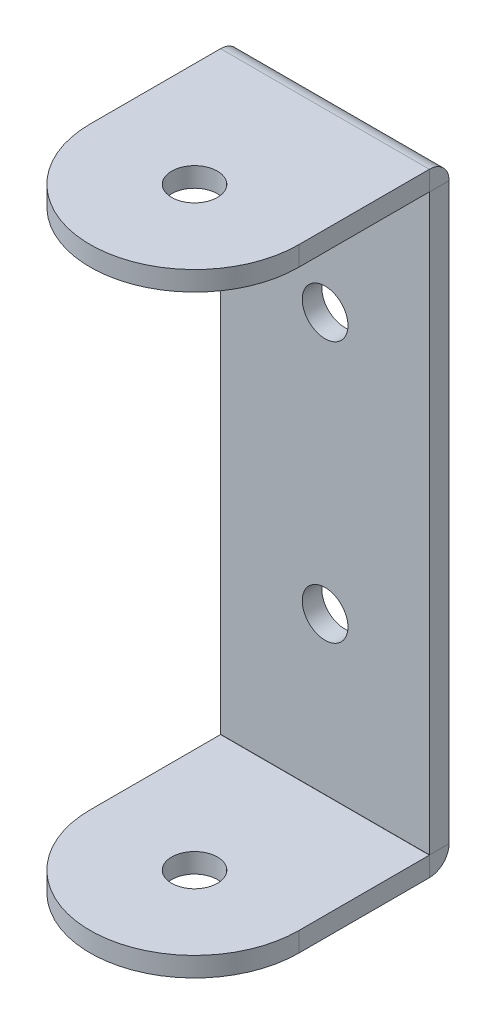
ISO-10303-21;
HEADER;
FILE_DESCRIPTION(('STEP AP214'),'2;1');
FILE_NAME('part.step','',(''),(''),'','','');
FILE_SCHEMA(('AUTOMOTIVE_DESIGN { 1 0 10303 214 1 1 1 1 }'));
ENDSEC;
DATA;
#1=APPLICATION_CONTEXT('core data for automotive mechanical design processes');
#2=APPLICATION_PROTOCOL_DEFINITION('international standard','automotive_design',2000,#1);
#3=PRODUCT_CONTEXT('',#1,'mechanical');
#4=PRODUCT('Part','Part','',(#3));
#5=PRODUCT_RELATED_PRODUCT_CATEGORY('part','',(#4));
#6=PRODUCT_DEFINITION_FORMATION('','',#4);
#7=PRODUCT_DEFINITION_CONTEXT('part definition',#1,'design');
#8=PRODUCT_DEFINITION('design','',#6,#7);
#9=PRODUCT_DEFINITION_SHAPE('','',#8);
#10=(LENGTH_UNIT() NAMED_UNIT(*) SI_UNIT(.MILLI.,.METRE.));
#11=(NAMED_UNIT(*) PLANE_ANGLE_UNIT() SI_UNIT($,.RADIAN.));
#12=(NAMED_UNIT(*) SI_UNIT($,.STERADIAN.) SOLID_ANGLE_UNIT());
#13=UNCERTAINTY_MEASURE_WITH_UNIT(LENGTH_MEASURE(1.E-05),#10,'distance_accuracy_value','');
#14=(GEOMETRIC_REPRESENTATION_CONTEXT(3) GLOBAL_UNCERTAINTY_ASSIGNED_CONTEXT((#13)) GLOBAL_UNIT_ASSIGNED_CONTEXT((#10,
#11,#12)) REPRESENTATION_CONTEXT('',''));
#15=CARTESIAN_POINT('',(0.,0.,0.));
#16=DIRECTION('',(0.,0.,1.));
#17=DIRECTION('',(1.,0.,0.));
#18=AXIS2_PLACEMENT_3D('',#15,#16,#17);
#19=CARTESIAN_POINT('',(0.,64.,1.5));
#20=DIRECTION('',(0.,0.,1.));
#21=DIRECTION('',(1.,0.,0.));
#22=AXIS2_PLACEMENT_3D('',#19,#20,#21);
#23=PLANE('',#22);
#24=CARTESIAN_POINT('',(0.,22.,1.5));
#25=DIRECTION('',(0.,0.,1.));
#26=DIRECTION('',(1.,0.,0.));
#27=AXIS2_PLACEMENT_3D('',#24,#25,#26);
#28=CIRCLE('',#27,1.75);
#29=CARTESIAN_POINT('',(1.75,22.,1.5));
#30=VERTEX_POINT('',#29);
#31=EDGE_CURVE('E231',#30,#30,#28,.T.);
#32=ORIENTED_EDGE('',*,*,#31,.F.);
#33=EDGE_LOOP('',(#32));
#34=FACE_BOUND('',#33,.T.);
#35=CARTESIAN_POINT('',(0.,42.,1.5));
#36=DIRECTION('',(0.,0.,1.));
#37=DIRECTION('',(1.,0.,0.));
#38=AXIS2_PLACEMENT_3D('',#35,#36,#37);
#39=CIRCLE('',#38,1.75);
#40=CARTESIAN_POINT('',(1.75,42.,1.5));
#41=VERTEX_POINT('',#40);
#42=EDGE_CURVE('E237',#41,#41,#39,.T.);
#43=ORIENTED_EDGE('',*,*,#42,.F.);
#44=EDGE_LOOP('',(#43));
#45=FACE_BOUND('',#44,.T.);
#46=DIRECTION('',(0.,-1.,0.));
#47=VECTOR('',#46,1.);
#48=CARTESIAN_POINT('',(-8.00000000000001,0.,1.5));
#49=LINE('',#48,#47);
#50=CARTESIAN_POINT('',(-8.00000000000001,53.9921342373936,1.5));
#51=VERTEX_POINT('',#50);
#52=CARTESIAN_POINT('',(-8.00000000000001,10.0078657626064,1.5));
#53=VERTEX_POINT('',#52);
#54=EDGE_CURVE('E45',#51,#53,#49,.T.);
#55=ORIENTED_EDGE('',*,*,#54,.T.);
#56=DIRECTION('',(1.,0.,0.));
#57=VECTOR('',#56,1.);
#58=CARTESIAN_POINT('',(0.,10.0078657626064,1.5));
#59=LINE('',#58,#57);
#60=CARTESIAN_POINT('',(8.00000000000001,10.0078657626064,1.5));
#61=VERTEX_POINT('',#60);
#62=EDGE_CURVE('E255',#53,#61,#59,.T.);
#63=ORIENTED_EDGE('',*,*,#62,.T.);
#64=DIRECTION('',(0.,1.,0.));
#65=VECTOR('',#64,1.);
#66=CARTESIAN_POINT('',(8.,64.,1.5));
#67=LINE('',#66,#65);
#68=CARTESIAN_POINT('',(8.,53.9921342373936,1.5));
#69=VERTEX_POINT('',#68);
#70=EDGE_CURVE('E246',#61,#69,#67,.T.);
#71=ORIENTED_EDGE('',*,*,#70,.T.);
#72=DIRECTION('',(-1.,0.,0.));
#73=VECTOR('',#72,1.);
#74=CARTESIAN_POINT('',(0.,53.9921342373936,1.5));
#75=LINE('',#74,#73);
#76=EDGE_CURVE('E242',#69,#51,#75,.T.);
#77=ORIENTED_EDGE('',*,*,#76,.T.);
#78=EDGE_LOOP('',(#55,#63,#71,#77));
#79=FACE_BOUND('',#78,.T.);
#80=ADVANCED_FACE('F41',(#34,#45,#79),#23,.T.);
#81=CARTESIAN_POINT('',(0.,64.,0.));
#82=DIRECTION('',(0.,0.,1.));
#83=DIRECTION('',(1.,0.,0.));
#84=AXIS2_PLACEMENT_3D('',#81,#82,#83);
#85=PLANE('',#84);
#86=DIRECTION('',(1.,0.,0.));
#87=VECTOR('',#86,1.);
#88=CARTESIAN_POINT('',(0.,10.0078657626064,0.));
#89=LINE('',#88,#87);
#90=CARTESIAN_POINT('',(-8.00000000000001,10.0078657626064,0.));
#91=VERTEX_POINT('',#90);
#92=CARTESIAN_POINT('',(8.00000000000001,10.0078657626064,0.));
#93=VERTEX_POINT('',#92);
#94=EDGE_CURVE('E50',#91,#93,#89,.T.);
#95=ORIENTED_EDGE('',*,*,#94,.F.);
#96=DIRECTION('',(0.,-1.,0.));
#97=VECTOR('',#96,1.);
#98=CARTESIAN_POINT('',(-8.00000000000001,0.,0.));
#99=LINE('',#98,#97);
#100=CARTESIAN_POINT('',(-8.00000000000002,53.9921342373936,0.));
#101=VERTEX_POINT('',#100);
#102=EDGE_CURVE('E66',#101,#91,#99,.T.);
#103=ORIENTED_EDGE('',*,*,#102,.F.);
#104=DIRECTION('',(-1.,0.,0.));
#105=VECTOR('',#104,1.);
#106=CARTESIAN_POINT('',(0.,53.9921342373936,0.));
#107=LINE('',#106,#105);
#108=CARTESIAN_POINT('',(8.,53.9921342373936,0.));
#109=VERTEX_POINT('',#108);
#110=EDGE_CURVE('E249',#109,#101,#107,.T.);
#111=ORIENTED_EDGE('',*,*,#110,.F.);
#112=DIRECTION('',(0.,1.,0.));
#113=VECTOR('',#112,1.);
#114=CARTESIAN_POINT('',(8.,64.,0.));
#115=LINE('',#114,#113);
#116=EDGE_CURVE('E58',#93,#109,#115,.T.);
#117=ORIENTED_EDGE('',*,*,#116,.F.);
#118=EDGE_LOOP('',(#95,#103,#111,#117));
#119=FACE_BOUND('',#118,.T.);
#120=CARTESIAN_POINT('',(0.,22.,0.));
#121=DIRECTION('',(0.,0.,1.));
#122=DIRECTION('',(1.,0.,0.));
#123=AXIS2_PLACEMENT_3D('',#120,#121,#122);
#124=CIRCLE('',#123,1.75);
#125=CARTESIAN_POINT('',(1.75,22.,0.));
#126=VERTEX_POINT('',#125);
#127=EDGE_CURVE('E226',#126,#126,#124,.T.);
#128=ORIENTED_EDGE('',*,*,#127,.T.);
#129=EDGE_LOOP('',(#128));
#130=FACE_BOUND('',#129,.T.);
#131=CARTESIAN_POINT('',(0.,42.,0.));
#132=DIRECTION('',(0.,0.,1.));
#133=DIRECTION('',(1.,0.,0.));
#134=AXIS2_PLACEMENT_3D('',#131,#132,#133);
#135=CIRCLE('',#134,1.75);
#136=CARTESIAN_POINT('',(1.75,42.,0.));
#137=VERTEX_POINT('',#136);
#138=EDGE_CURVE('E234',#137,#137,#135,.T.);
#139=ORIENTED_EDGE('',*,*,#138,.T.);
#140=EDGE_LOOP('',(#139));
#141=FACE_BOUND('',#140,.T.);
#142=ADVANCED_FACE('F294',(#119,#130,#141),#85,.F.);
#143=CARTESIAN_POINT('',(-8.00000000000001,0.,1.5));
#144=DIRECTION('',(1.,0.,0.));
#145=DIRECTION('',(0.,1.,0.));
#146=AXIS2_PLACEMENT_3D('',#143,#144,#145);
#147=PLANE('',#146);
#148=DIRECTION('',(0.,0.,-1.));
#149=VECTOR('',#148,1.);
#150=CARTESIAN_POINT('',(-8.00000000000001,10.0078657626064,1.50000000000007));
#151=LINE('',#150,#149);
#152=EDGE_CURVE('E258',#53,#91,#151,.T.);
#153=ORIENTED_EDGE('',*,*,#152,.F.);
#154=ORIENTED_EDGE('',*,*,#54,.F.);
#155=DIRECTION('',(0.,0.,1.));
#156=VECTOR('',#155,1.);
#157=CARTESIAN_POINT('',(-8.00000000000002,53.9921342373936,1.50000000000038));
#158=LINE('',#157,#156);
#159=EDGE_CURVE('E252',#101,#51,#158,.T.);
#160=ORIENTED_EDGE('',*,*,#159,.F.);
#161=ORIENTED_EDGE('',*,*,#102,.T.);
#162=EDGE_LOOP('',(#153,#154,#160,#161));
#163=FACE_BOUND('',#162,.T.);
#164=ADVANCED_FACE('F268',(#163),#147,.F.);
#165=CARTESIAN_POINT('',(8.,64.,1.5));
#166=DIRECTION('',(-1.,0.,0.));
#167=DIRECTION('',(0.,-1.,0.));
#168=AXIS2_PLACEMENT_3D('',#165,#166,#167);
#169=PLANE('',#168);
#170=DIRECTION('',(0.,0.,1.));
#171=VECTOR('',#170,1.);
#172=CARTESIAN_POINT('',(8.00000000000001,10.0078657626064,1.49999999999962));
#173=LINE('',#172,#171);
#174=EDGE_CURVE('E12',#93,#61,#173,.T.);
#175=ORIENTED_EDGE('',*,*,#174,.F.);
#176=ORIENTED_EDGE('',*,*,#116,.T.);
#177=DIRECTION('',(0.,0.,-1.));
#178=VECTOR('',#177,1.);
#179=CARTESIAN_POINT('',(8.,53.9921342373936,1.49999999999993));
#180=LINE('',#179,#178);
#181=EDGE_CURVE('E245',#69,#109,#180,.T.);
#182=ORIENTED_EDGE('',*,*,#181,.F.);
#183=ORIENTED_EDGE('',*,*,#70,.F.);
#184=EDGE_LOOP('',(#175,#176,#182,#183));
#185=FACE_BOUND('',#184,.T.);
#186=ADVANCED_FACE('F43',(#185),#169,.F.);
#187=CARTESIAN_POINT('',(0.,42.,1.5));
#188=DIRECTION('',(0.,0.,-1.));
#189=DIRECTION('',(-1.,0.,0.));
#190=AXIS2_PLACEMENT_3D('',#187,#188,#189);
#191=CYLINDRICAL_SURFACE('',#190,1.75);
#192=ORIENTED_EDGE('',*,*,#42,.T.);
#193=EDGE_LOOP('',(#192));
#194=FACE_BOUND('',#193,.T.);
#195=ORIENTED_EDGE('',*,*,#138,.F.);
#196=EDGE_LOOP('',(#195));
#197=FACE_BOUND('',#196,.T.);
#198=ADVANCED_FACE('F347',(#194,#197),#191,.F.);
#199=CARTESIAN_POINT('',(0.,22.,1.5));
#200=DIRECTION('',(0.,0.,-1.));
#201=DIRECTION('',(-1.,0.,0.));
#202=AXIS2_PLACEMENT_3D('',#199,#200,#201);
#203=CYLINDRICAL_SURFACE('',#202,1.75);
#204=ORIENTED_EDGE('',*,*,#31,.T.);
#205=EDGE_LOOP('',(#204));
#206=FACE_BOUND('',#205,.T.);
#207=ORIENTED_EDGE('',*,*,#127,.F.);
#208=EDGE_LOOP('',(#207));
#209=FACE_BOUND('',#208,.T.);
#210=ADVANCED_FACE('F356',(#206,#209),#203,.F.);
#211=CARTESIAN_POINT('',(8.,53.9921342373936,1.51));
#212=DIRECTION('',(-1.,0.,0.));
#213=DIRECTION('',(0.,0.,1.));
#214=AXIS2_PLACEMENT_3D('',#211,#212,#213);
#215=PLANE('',#214);
#216=ORIENTED_EDGE('',*,*,#181,.T.);
#217=CARTESIAN_POINT('',(8.,53.9921342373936,1.51));
#218=DIRECTION('',(-1.,0.,0.));
#219=DIRECTION('',(0.,0.,1.));
#220=AXIS2_PLACEMENT_3D('',#217,#218,#219);
#221=CIRCLE('',#220,1.51);
#222=CARTESIAN_POINT('',(8.,55.5021342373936,1.51));
#223=VERTEX_POINT('',#222);
#224=EDGE_CURVE('E184',#109,#223,#221,.F.);
#225=ORIENTED_EDGE('',*,*,#224,.T.);
#226=DIRECTION('',(0.,1.,0.));
#227=VECTOR('',#226,1.);
#228=CARTESIAN_POINT('',(8.,54.0021342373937,1.50999999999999));
#229=LINE('',#228,#227);
#230=CARTESIAN_POINT('',(8.,54.0021342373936,1.51));
#231=VERTEX_POINT('',#230);
#232=EDGE_CURVE('E197',#231,#223,#229,.T.);
#233=ORIENTED_EDGE('',*,*,#232,.F.);
#234=CARTESIAN_POINT('',(8.,53.9921342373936,1.51));
#235=DIRECTION('',(1.,0.,0.));
#236=DIRECTION('',(0.,0.,-1.));
#237=AXIS2_PLACEMENT_3D('',#234,#235,#236);
#238=CIRCLE('',#237,0.0100000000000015);
#239=EDGE_CURVE('E219',#69,#231,#238,.T.);
#240=ORIENTED_EDGE('',*,*,#239,.F.);
#241=EDGE_LOOP('',(#216,#225,#233,#240));
#242=FACE_BOUND('',#241,.T.);
#243=ADVANCED_FACE('F318',(#242),#215,.F.);
#244=CARTESIAN_POINT('',(-8.00000000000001,53.9921342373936,1.51));
#245=DIRECTION('',(1.,0.,0.));
#246=DIRECTION('',(0.,0.,-1.));
#247=AXIS2_PLACEMENT_3D('',#244,#245,#246);
#248=PLANE('',#247);
#249=CARTESIAN_POINT('',(-8.00000000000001,53.9921342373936,1.51));
#250=DIRECTION('',(-1.,0.,0.));
#251=DIRECTION('',(0.,0.,1.));
#252=AXIS2_PLACEMENT_3D('',#249,#250,#251);
#253=CIRCLE('',#252,1.51);
#254=CARTESIAN_POINT('',(-8.00000000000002,55.5021342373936,1.51));
#255=VERTEX_POINT('',#254);
#256=EDGE_CURVE('E223',#255,#101,#253,.T.);
#257=ORIENTED_EDGE('',*,*,#256,.T.);
#258=ORIENTED_EDGE('',*,*,#159,.T.);
#259=CARTESIAN_POINT('',(-8.00000000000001,53.9921342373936,1.51));
#260=DIRECTION('',(-1.,0.,0.));
#261=DIRECTION('',(0.,0.,1.));
#262=AXIS2_PLACEMENT_3D('',#259,#260,#261);
#263=CIRCLE('',#262,0.0100000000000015);
#264=CARTESIAN_POINT('',(-8.00000000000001,54.0021342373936,1.51));
#265=VERTEX_POINT('',#264);
#266=EDGE_CURVE('E222',#265,#51,#263,.T.);
#267=ORIENTED_EDGE('',*,*,#266,.F.);
#268=DIRECTION('',(0.,-1.,0.));
#269=VECTOR('',#268,1.);
#270=CARTESIAN_POINT('',(-8.00000000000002,54.0021342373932,1.50999999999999));
#271=LINE('',#270,#269);
#272=EDGE_CURVE('E185',#255,#265,#271,.T.);
#273=ORIENTED_EDGE('',*,*,#272,.F.);
#274=EDGE_LOOP('',(#257,#258,#267,#273));
#275=FACE_BOUND('',#274,.T.);
#276=ADVANCED_FACE('F304',(#275),#248,.F.);
#277=CARTESIAN_POINT('',(16.0701663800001,53.9921342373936,1.51));
#278=DIRECTION('',(-1.,0.,0.));
#279=DIRECTION('',(0.,0.,1.));
#280=AXIS2_PLACEMENT_3D('',#277,#278,#279);
#281=CYLINDRICAL_SURFACE('',#280,0.01);
#282=DIRECTION('',(-1.,0.,0.));
#283=VECTOR('',#282,1.);
#284=CARTESIAN_POINT('',(0.,54.0021342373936,1.50999999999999));
#285=LINE('',#284,#283);
#286=EDGE_CURVE('E174',#231,#265,#285,.T.);
#287=ORIENTED_EDGE('',*,*,#286,.T.);
#288=ORIENTED_EDGE('',*,*,#266,.T.);
#289=ORIENTED_EDGE('',*,*,#76,.F.);
#290=ORIENTED_EDGE('',*,*,#239,.T.);
#291=EDGE_LOOP('',(#287,#288,#289,#290));
#292=FACE_BOUND('',#291,.T.);
#293=ADVANCED_FACE('F314',(#292),#281,.F.);
#294=CARTESIAN_POINT('',(16.0701663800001,53.9921342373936,1.51));
#295=DIRECTION('',(-1.,0.,0.));
#296=DIRECTION('',(0.,0.,1.));
#297=AXIS2_PLACEMENT_3D('',#294,#295,#296);
#298=CYLINDRICAL_SURFACE('',#297,1.51);
#299=DIRECTION('',(-1.,0.,0.));
#300=VECTOR('',#299,1.);
#301=CARTESIAN_POINT('',(0.,55.5021342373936,1.51));
#302=LINE('',#301,#300);
#303=EDGE_CURVE('E189',#223,#255,#302,.T.);
#304=ORIENTED_EDGE('',*,*,#303,.F.);
#305=ORIENTED_EDGE('',*,*,#224,.F.);
#306=ORIENTED_EDGE('',*,*,#110,.T.);
#307=ORIENTED_EDGE('',*,*,#256,.F.);
#308=EDGE_LOOP('',(#304,#305,#306,#307));
#309=FACE_BOUND('',#308,.T.);
#310=ADVANCED_FACE('F302',(#309),#298,.T.);
#311=CARTESIAN_POINT('',(0.,54.0021342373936,11.5021342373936));
#312=DIRECTION('',(0.,1.,0.));
#313=DIRECTION('',(-1.,0.,0.));
#314=AXIS2_PLACEMENT_3D('',#311,#312,#313);
#315=CYLINDRICAL_SURFACE('',#314,1.75);
#316=CARTESIAN_POINT('',(0.,54.0021342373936,11.5021342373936));
#317=DIRECTION('',(0.,-1.,0.));
#318=DIRECTION('',(1.,0.,0.));
#319=AXIS2_PLACEMENT_3D('',#316,#317,#318);
#320=CIRCLE('',#319,1.75);
#321=CARTESIAN_POINT('',(1.74999999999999,54.0021342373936,11.5021342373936));
#322=VERTEX_POINT('',#321);
#323=EDGE_CURVE('E214',#322,#322,#320,.T.);
#324=ORIENTED_EDGE('',*,*,#323,.T.);
#325=EDGE_LOOP('',(#324));
#326=FACE_BOUND('',#325,.T.);
#327=CARTESIAN_POINT('',(0.,55.5021342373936,11.5021342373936));
#328=DIRECTION('',(0.,-1.,0.));
#329=DIRECTION('',(1.,0.,0.));
#330=AXIS2_PLACEMENT_3D('',#327,#328,#329);
#331=CIRCLE('',#330,1.75);
#332=CARTESIAN_POINT('',(1.74999999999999,55.5021342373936,11.5021342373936));
#333=VERTEX_POINT('',#332);
#334=EDGE_CURVE('E192',#333,#333,#331,.T.);
#335=ORIENTED_EDGE('',*,*,#334,.F.);
#336=EDGE_LOOP('',(#335));
#337=FACE_BOUND('',#336,.T.);
#338=ADVANCED_FACE('F328',(#326,#337),#315,.F.);
#339=CARTESIAN_POINT('',(0.,54.0021342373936,11.5021342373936));
#340=DIRECTION('',(0.,1.,0.));
#341=DIRECTION('',(-1.,0.,0.));
#342=AXIS2_PLACEMENT_3D('',#339,#340,#341);
#343=CYLINDRICAL_SURFACE('',#342,8.00000000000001);
#344=CARTESIAN_POINT('',(0.,55.5021342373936,11.5021342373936));
#345=DIRECTION('',(0.,-1.,0.));
#346=DIRECTION('',(1.,0.,0.));
#347=AXIS2_PLACEMENT_3D('',#344,#345,#346);
#348=CIRCLE('',#347,8.00000000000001);
#349=CARTESIAN_POINT('',(8.,55.5021342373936,11.5021342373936));
#350=VERTEX_POINT('',#349);
#351=CARTESIAN_POINT('',(-8.00000000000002,55.5021342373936,11.5021342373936));
#352=VERTEX_POINT('',#351);
#353=EDGE_CURVE('E211',#350,#352,#348,.T.);
#354=ORIENTED_EDGE('',*,*,#353,.T.);
#355=DIRECTION('',(0.,1.,0.));
#356=VECTOR('',#355,1.);
#357=CARTESIAN_POINT('',(-8.00000000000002,54.0021342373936,11.5021342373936));
#358=LINE('',#357,#356);
#359=CARTESIAN_POINT('',(-8.00000000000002,54.0021342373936,11.5021342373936));
#360=VERTEX_POINT('',#359);
#361=EDGE_CURVE('E181',#360,#352,#358,.T.);
#362=ORIENTED_EDGE('',*,*,#361,.F.);
#363=CARTESIAN_POINT('',(0.,54.0021342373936,11.5021342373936));
#364=DIRECTION('',(0.,-1.,0.));
#365=DIRECTION('',(1.,0.,0.));
#366=AXIS2_PLACEMENT_3D('',#363,#364,#365);
#367=CIRCLE('',#366,8.00000000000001);
#368=CARTESIAN_POINT('',(8.,54.0021342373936,11.5021342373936));
#369=VERTEX_POINT('',#368);
#370=EDGE_CURVE('E203',#369,#360,#367,.T.);
#371=ORIENTED_EDGE('',*,*,#370,.F.);
#372=DIRECTION('',(0.,1.,0.));
#373=VECTOR('',#372,1.);
#374=CARTESIAN_POINT('',(8.,54.0021342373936,11.5021342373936));
#375=LINE('',#374,#373);
#376=EDGE_CURVE('E208',#369,#350,#375,.T.);
#377=ORIENTED_EDGE('',*,*,#376,.T.);
#378=EDGE_LOOP('',(#354,#362,#371,#377));
#379=FACE_BOUND('',#378,.T.);
#380=ADVANCED_FACE('F326',(#379),#343,.T.);
#381=CARTESIAN_POINT('',(0.,54.0021342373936,11.5021342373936));
#382=DIRECTION('',(0.,-1.,0.));
#383=DIRECTION('',(1.,0.,0.));
#384=AXIS2_PLACEMENT_3D('',#381,#382,#383);
#385=PLANE('',#384);
#386=ORIENTED_EDGE('',*,*,#286,.F.);
#387=DIRECTION('',(0.,0.,1.));
#388=VECTOR('',#387,1.);
#389=CARTESIAN_POINT('',(8.,54.0021342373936,11.5021342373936));
#390=LINE('',#389,#388);
#391=EDGE_CURVE('E206',#231,#369,#390,.T.);
#392=ORIENTED_EDGE('',*,*,#391,.T.);
#393=ORIENTED_EDGE('',*,*,#370,.T.);
#394=DIRECTION('',(0.,0.,-1.));
#395=VECTOR('',#394,1.);
#396=CARTESIAN_POINT('',(-8.00000000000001,54.0021342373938,-52.4978657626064));
#397=LINE('',#396,#395);
#398=EDGE_CURVE('E200',#360,#265,#397,.T.);
#399=ORIENTED_EDGE('',*,*,#398,.T.);
#400=EDGE_LOOP('',(#386,#392,#393,#399));
#401=FACE_BOUND('',#400,.T.);
#402=ORIENTED_EDGE('',*,*,#323,.F.);
#403=EDGE_LOOP('',(#402));
#404=FACE_BOUND('',#403,.T.);
#405=ADVANCED_FACE('F308',(#401,#404),#385,.T.);
#406=CARTESIAN_POINT('',(8.,54.0021342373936,11.5021342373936));
#407=DIRECTION('',(-1.,0.,0.));
#408=DIRECTION('',(0.,0.,-1.));
#409=AXIS2_PLACEMENT_3D('',#406,#407,#408);
#410=PLANE('',#409);
#411=ORIENTED_EDGE('',*,*,#391,.F.);
#412=ORIENTED_EDGE('',*,*,#232,.T.);
#413=DIRECTION('',(0.,0.,1.));
#414=VECTOR('',#413,1.);
#415=CARTESIAN_POINT('',(8.,55.5021342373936,11.5021342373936));
#416=LINE('',#415,#414);
#417=EDGE_CURVE('E195',#223,#350,#416,.T.);
#418=ORIENTED_EDGE('',*,*,#417,.T.);
#419=ORIENTED_EDGE('',*,*,#376,.F.);
#420=EDGE_LOOP('',(#411,#412,#418,#419));
#421=FACE_BOUND('',#420,.T.);
#422=ADVANCED_FACE('F320',(#421),#410,.F.);
#423=CARTESIAN_POINT('',(0.,55.5021342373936,11.5021342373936));
#424=DIRECTION('',(0.,-1.,0.));
#425=DIRECTION('',(1.,0.,0.));
#426=AXIS2_PLACEMENT_3D('',#423,#424,#425);
#427=PLANE('',#426);
#428=ORIENTED_EDGE('',*,*,#334,.T.);
#429=EDGE_LOOP('',(#428));
#430=FACE_BOUND('',#429,.T.);
#431=ORIENTED_EDGE('',*,*,#417,.F.);
#432=ORIENTED_EDGE('',*,*,#303,.T.);
#433=DIRECTION('',(0.,0.,-1.));
#434=VECTOR('',#433,1.);
#435=CARTESIAN_POINT('',(-8.00000000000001,55.5021342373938,-52.4978657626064));
#436=LINE('',#435,#434);
#437=EDGE_CURVE('E187',#352,#255,#436,.T.);
#438=ORIENTED_EDGE('',*,*,#437,.F.);
#439=ORIENTED_EDGE('',*,*,#353,.F.);
#440=EDGE_LOOP('',(#431,#432,#438,#439));
#441=FACE_BOUND('',#440,.T.);
#442=ADVANCED_FACE('F323',(#430,#441),#427,.F.);
#443=CARTESIAN_POINT('',(-8.00000000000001,54.0021342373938,-52.4978657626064));
#444=DIRECTION('',(1.,0.,0.));
#445=DIRECTION('',(0.,0.,1.));
#446=AXIS2_PLACEMENT_3D('',#443,#444,#445);
#447=PLANE('',#446);
#448=ORIENTED_EDGE('',*,*,#437,.T.);
#449=ORIENTED_EDGE('',*,*,#272,.T.);
#450=ORIENTED_EDGE('',*,*,#398,.F.);
#451=ORIENTED_EDGE('',*,*,#361,.T.);
#452=EDGE_LOOP('',(#448,#449,#450,#451));
#453=FACE_BOUND('',#452,.T.);
#454=ADVANCED_FACE('F306',(#453),#447,.F.);
#455=CARTESIAN_POINT('',(-8.00000000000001,10.0078657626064,1.51));
#456=DIRECTION('',(1.,0.,0.));
#457=DIRECTION('',(0.,0.,-1.));
#458=AXIS2_PLACEMENT_3D('',#455,#456,#457);
#459=PLANE('',#458);
#460=ORIENTED_EDGE('',*,*,#152,.T.);
#461=CARTESIAN_POINT('',(-8.00000000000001,10.0078657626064,1.51));
#462=DIRECTION('',(1.,0.,0.));
#463=DIRECTION('',(0.,0.,-1.));
#464=AXIS2_PLACEMENT_3D('',#461,#462,#463);
#465=CIRCLE('',#464,1.51);
#466=CARTESIAN_POINT('',(-8.00000000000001,8.49786576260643,1.51000000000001));
#467=VERTEX_POINT('',#466);
#468=EDGE_CURVE('E175',#91,#467,#465,.F.);
#469=ORIENTED_EDGE('',*,*,#468,.T.);
#470=DIRECTION('',(0.,-1.,0.));
#471=VECTOR('',#470,1.);
#472=CARTESIAN_POINT('',(-8.00000000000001,9.9978657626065,1.51000000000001));
#473=LINE('',#472,#471);
#474=CARTESIAN_POINT('',(-8.00000000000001,9.99786576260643,1.51));
#475=VERTEX_POINT('',#474);
#476=EDGE_CURVE('E140',#475,#467,#473,.T.);
#477=ORIENTED_EDGE('',*,*,#476,.F.);
#478=CARTESIAN_POINT('',(-8.00000000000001,10.0078657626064,1.51));
#479=DIRECTION('',(-1.,0.,0.));
#480=DIRECTION('',(0.,0.,1.));
#481=AXIS2_PLACEMENT_3D('',#478,#479,#480);
#482=CIRCLE('',#481,0.00999999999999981);
#483=EDGE_CURVE('E167',#53,#475,#482,.T.);
#484=ORIENTED_EDGE('',*,*,#483,.F.);
#485=EDGE_LOOP('',(#460,#469,#477,#484));
#486=FACE_BOUND('',#485,.T.);
#487=ADVANCED_FACE('F275',(#486),#459,.F.);
#488=CARTESIAN_POINT('',(8.00000000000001,10.0078657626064,1.51));
#489=DIRECTION('',(-1.,0.,0.));
#490=DIRECTION('',(0.,0.,1.));
#491=AXIS2_PLACEMENT_3D('',#488,#489,#490);
#492=PLANE('',#491);
#493=CARTESIAN_POINT('',(8.00000000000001,10.0078657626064,1.51));
#494=DIRECTION('',(1.,0.,0.));
#495=DIRECTION('',(0.,0.,-1.));
#496=AXIS2_PLACEMENT_3D('',#493,#494,#495);
#497=CIRCLE('',#496,1.51);
#498=CARTESIAN_POINT('',(8.00000000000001,8.49786576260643,1.51));
#499=VERTEX_POINT('',#498);
#500=EDGE_CURVE('E171',#499,#93,#497,.T.);
#501=ORIENTED_EDGE('',*,*,#500,.T.);
#502=ORIENTED_EDGE('',*,*,#174,.T.);
#503=CARTESIAN_POINT('',(8.00000000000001,10.0078657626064,1.51));
#504=DIRECTION('',(1.,0.,0.));
#505=DIRECTION('',(0.,0.,-1.));
#506=AXIS2_PLACEMENT_3D('',#503,#504,#505);
#507=CIRCLE('',#506,0.00999999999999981);
#508=CARTESIAN_POINT('',(8.00000000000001,9.99786576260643,1.51));
#509=VERTEX_POINT('',#508);
#510=EDGE_CURVE('E170',#509,#61,#507,.T.);
#511=ORIENTED_EDGE('',*,*,#510,.F.);
#512=DIRECTION('',(0.,1.,0.));
#513=VECTOR('',#512,1.);
#514=CARTESIAN_POINT('',(8.00000000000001,9.99786576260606,1.51000000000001));
#515=LINE('',#514,#513);
#516=EDGE_CURVE('E289',#499,#509,#515,.T.);
#517=ORIENTED_EDGE('',*,*,#516,.F.);
#518=EDGE_LOOP('',(#501,#502,#511,#517));
#519=FACE_BOUND('',#518,.T.);
#520=ADVANCED_FACE('F288',(#519),#492,.F.);
#521=CARTESIAN_POINT('',(-16.0701663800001,10.0078657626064,1.51));
#522=DIRECTION('',(1.,0.,0.));
#523=DIRECTION('',(0.,0.,-1.));
#524=AXIS2_PLACEMENT_3D('',#521,#522,#523);
#525=CYLINDRICAL_SURFACE('',#524,0.01);
#526=DIRECTION('',(1.,0.,0.));
#527=VECTOR('',#526,1.);
#528=CARTESIAN_POINT('',(0.,9.99786576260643,1.51000000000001));
#529=LINE('',#528,#527);
#530=EDGE_CURVE('E161',#475,#509,#529,.T.);
#531=ORIENTED_EDGE('',*,*,#530,.T.);
#532=ORIENTED_EDGE('',*,*,#510,.T.);
#533=ORIENTED_EDGE('',*,*,#62,.F.);
#534=ORIENTED_EDGE('',*,*,#483,.T.);
#535=EDGE_LOOP('',(#531,#532,#533,#534));
#536=FACE_BOUND('',#535,.T.);
#537=ADVANCED_FACE('F273',(#536),#525,.F.);
#538=CARTESIAN_POINT('',(-16.0701663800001,10.0078657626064,1.51));
#539=DIRECTION('',(1.,0.,0.));
#540=DIRECTION('',(0.,0.,-1.));
#541=AXIS2_PLACEMENT_3D('',#538,#539,#540);
#542=CYLINDRICAL_SURFACE('',#541,1.51);
#543=DIRECTION('',(1.,0.,0.));
#544=VECTOR('',#543,1.);
#545=CARTESIAN_POINT('',(0.,8.49786576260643,1.51));
#546=LINE('',#545,#544);
#547=EDGE_CURVE('E605',#467,#499,#546,.T.);
#548=ORIENTED_EDGE('',*,*,#547,.F.);
#549=ORIENTED_EDGE('',*,*,#468,.F.);
#550=ORIENTED_EDGE('',*,*,#94,.T.);
#551=ORIENTED_EDGE('',*,*,#500,.F.);
#552=EDGE_LOOP('',(#548,#549,#550,#551));
#553=FACE_BOUND('',#552,.T.);
#554=ADVANCED_FACE('F293',(#553),#542,.T.);
#555=CARTESIAN_POINT('',(0.,9.99786576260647,11.5021342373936));
#556=DIRECTION('',(0.,-1.,0.));
#557=DIRECTION('',(-1.,0.,0.));
#558=AXIS2_PLACEMENT_3D('',#555,#556,#557);
#559=CYLINDRICAL_SURFACE('',#558,1.75);
#560=CARTESIAN_POINT('',(0.,9.99786576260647,11.5021342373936));
#561=DIRECTION('',(0.,1.,0.));
#562=DIRECTION('',(1.,0.,0.));
#563=AXIS2_PLACEMENT_3D('',#560,#561,#562);
#564=CIRCLE('',#563,1.75);
#565=CARTESIAN_POINT('',(1.75,9.99786576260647,11.5021342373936));
#566=VERTEX_POINT('',#565);
#567=EDGE_CURVE('E158',#566,#566,#564,.T.);
#568=ORIENTED_EDGE('',*,*,#567,.T.);
#569=EDGE_LOOP('',(#568));
#570=FACE_BOUND('',#569,.T.);
#571=CARTESIAN_POINT('',(0.,8.49786576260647,11.5021342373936));
#572=DIRECTION('',(0.,1.,0.));
#573=DIRECTION('',(1.,0.,0.));
#574=AXIS2_PLACEMENT_3D('',#571,#572,#573);
#575=CIRCLE('',#574,1.75);
#576=CARTESIAN_POINT('',(1.75,8.49786576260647,11.5021342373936));
#577=VERTEX_POINT('',#576);
#578=EDGE_CURVE('E145',#577,#577,#575,.T.);
#579=ORIENTED_EDGE('',*,*,#578,.F.);
#580=EDGE_LOOP('',(#579));
#581=FACE_BOUND('',#580,.T.);
#582=ADVANCED_FACE('F420',(#570,#581),#559,.F.);
#583=CARTESIAN_POINT('',(0.,9.99786576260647,11.5021342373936));
#584=DIRECTION('',(0.,-1.,0.));
#585=DIRECTION('',(-1.,0.,0.));
#586=AXIS2_PLACEMENT_3D('',#583,#584,#585);
#587=CYLINDRICAL_SURFACE('',#586,8.00000000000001);
#588=CARTESIAN_POINT('',(0.,8.49786576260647,11.5021342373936));
#589=DIRECTION('',(0.,1.,0.));
#590=DIRECTION('',(1.,0.,0.));
#591=AXIS2_PLACEMENT_3D('',#588,#589,#590);
#592=CIRCLE('',#591,8.00000000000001);
#593=CARTESIAN_POINT('',(-8.00000000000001,8.49786576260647,11.5021342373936));
#594=VERTEX_POINT('',#593);
#595=CARTESIAN_POINT('',(8.00000000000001,8.49786576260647,11.5021342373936));
#596=VERTEX_POINT('',#595);
#597=EDGE_CURVE('E150',#594,#596,#592,.T.);
#598=ORIENTED_EDGE('',*,*,#597,.T.);
#599=DIRECTION('',(0.,-1.,0.));
#600=VECTOR('',#599,1.);
#601=CARTESIAN_POINT('',(8.00000000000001,9.99786576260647,11.5021342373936));
#602=LINE('',#601,#600);
#603=CARTESIAN_POINT('',(8.00000000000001,9.99786576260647,11.5021342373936));
#604=VERTEX_POINT('',#603);
#605=EDGE_CURVE('E178',#604,#596,#602,.T.);
#606=ORIENTED_EDGE('',*,*,#605,.F.);
#607=CARTESIAN_POINT('',(0.,9.99786576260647,11.5021342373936));
#608=DIRECTION('',(0.,1.,0.));
#609=DIRECTION('',(1.,0.,0.));
#610=AXIS2_PLACEMENT_3D('',#607,#608,#609);
#611=CIRCLE('',#610,8.00000000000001);
#612=CARTESIAN_POINT('',(-8.00000000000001,9.99786576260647,11.5021342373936));
#613=VERTEX_POINT('',#612);
#614=EDGE_CURVE('E152',#613,#604,#611,.T.);
#615=ORIENTED_EDGE('',*,*,#614,.F.);
#616=DIRECTION('',(0.,-1.,0.));
#617=VECTOR('',#616,1.);
#618=CARTESIAN_POINT('',(-8.00000000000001,9.99786576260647,11.5021342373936));
#619=LINE('',#618,#617);
#620=EDGE_CURVE('E137',#613,#594,#619,.T.);
#621=ORIENTED_EDGE('',*,*,#620,.T.);
#622=EDGE_LOOP('',(#598,#606,#615,#621));
#623=FACE_BOUND('',#622,.T.);
#624=ADVANCED_FACE('F148',(#623),#587,.T.);
#625=CARTESIAN_POINT('',(0.,9.99786576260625,-52.4978657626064));
#626=DIRECTION('',(0.,1.,0.));
#627=DIRECTION('',(1.,0.,0.));
#628=AXIS2_PLACEMENT_3D('',#625,#626,#627);
#629=PLANE('',#628);
#630=ORIENTED_EDGE('',*,*,#530,.F.);
#631=DIRECTION('',(0.,0.,1.));
#632=VECTOR('',#631,1.);
#633=CARTESIAN_POINT('',(-8.00000000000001,9.99786576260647,11.5021342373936));
#634=LINE('',#633,#632);
#635=EDGE_CURVE('E153',#475,#613,#634,.T.);
#636=ORIENTED_EDGE('',*,*,#635,.T.);
#637=ORIENTED_EDGE('',*,*,#614,.T.);
#638=DIRECTION('',(0.,0.,-1.));
#639=VECTOR('',#638,1.);
#640=CARTESIAN_POINT('',(8.,9.99786576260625,-52.4978657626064));
#641=LINE('',#640,#639);
#642=EDGE_CURVE('E276',#604,#509,#641,.T.);
#643=ORIENTED_EDGE('',*,*,#642,.T.);
#644=EDGE_LOOP('',(#630,#636,#637,#643));
#645=FACE_BOUND('',#644,.T.);
#646=ORIENTED_EDGE('',*,*,#567,.F.);
#647=EDGE_LOOP('',(#646));
#648=FACE_BOUND('',#647,.T.);
#649=ADVANCED_FACE('F283',(#645,#648),#629,.T.);
#650=CARTESIAN_POINT('',(-8.00000000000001,9.99786576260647,11.5021342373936));
#651=DIRECTION('',(1.,0.,0.));
#652=DIRECTION('',(0.,0.,-1.));
#653=AXIS2_PLACEMENT_3D('',#650,#651,#652);
#654=PLANE('',#653);
#655=ORIENTED_EDGE('',*,*,#635,.F.);
#656=ORIENTED_EDGE('',*,*,#476,.T.);
#657=DIRECTION('',(0.,0.,1.));
#658=VECTOR('',#657,1.);
#659=CARTESIAN_POINT('',(-8.00000000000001,8.49786576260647,11.5021342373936));
#660=LINE('',#659,#658);
#661=EDGE_CURVE('E133',#467,#594,#660,.T.);
#662=ORIENTED_EDGE('',*,*,#661,.T.);
#663=ORIENTED_EDGE('',*,*,#620,.F.);
#664=EDGE_LOOP('',(#655,#656,#662,#663));
#665=FACE_BOUND('',#664,.T.);
#666=ADVANCED_FACE('F136',(#665),#654,.F.);
#667=CARTESIAN_POINT('',(0.,8.49786576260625,-52.4978657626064));
#668=DIRECTION('',(0.,1.,0.));
#669=DIRECTION('',(1.,0.,0.));
#670=AXIS2_PLACEMENT_3D('',#667,#668,#669);
#671=PLANE('',#670);
#672=ORIENTED_EDGE('',*,*,#578,.T.);
#673=EDGE_LOOP('',(#672));
#674=FACE_BOUND('',#673,.T.);
#675=ORIENTED_EDGE('',*,*,#661,.F.);
#676=ORIENTED_EDGE('',*,*,#547,.T.);
#677=DIRECTION('',(0.,0.,-1.));
#678=VECTOR('',#677,1.);
#679=CARTESIAN_POINT('',(8.,8.49786576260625,-52.4978657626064));
#680=LINE('',#679,#678);
#681=EDGE_CURVE('E157',#596,#499,#680,.T.);
#682=ORIENTED_EDGE('',*,*,#681,.F.);
#683=ORIENTED_EDGE('',*,*,#597,.F.);
#684=EDGE_LOOP('',(#675,#676,#682,#683));
#685=FACE_BOUND('',#684,.T.);
#686=ADVANCED_FACE('F156',(#674,#685),#671,.F.);
#687=CARTESIAN_POINT('',(8.,9.99786576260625,-52.4978657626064));
#688=DIRECTION('',(-1.,0.,0.));
#689=DIRECTION('',(0.,0.,1.));
#690=AXIS2_PLACEMENT_3D('',#687,#688,#689);
#691=PLANE('',#690);
#692=ORIENTED_EDGE('',*,*,#681,.T.);
#693=ORIENTED_EDGE('',*,*,#516,.T.);
#694=ORIENTED_EDGE('',*,*,#642,.F.);
#695=ORIENTED_EDGE('',*,*,#605,.T.);
#696=EDGE_LOOP('',(#692,#693,#694,#695));
#697=FACE_BOUND('',#696,.T.);
#698=ADVANCED_FACE('F452',(#697),#691,.F.);
#699=CLOSED_SHELL('',(#80,#142,#164,#186,#198,#210,#243,#276,#293,#310,#338,#380,#405,#422,#442,
#454,#487,#520,#537,#554,#582,#624,#649,#666,#686,#698));
#700=MANIFOLD_SOLID_BREP('B2',#699);
#701=ADVANCED_BREP_SHAPE_REPRESENTATION('',(#18,#700),#14);
#702=SHAPE_DEFINITION_REPRESENTATION(#9,#701);
ENDSEC;
END-ISO-10303-21;
